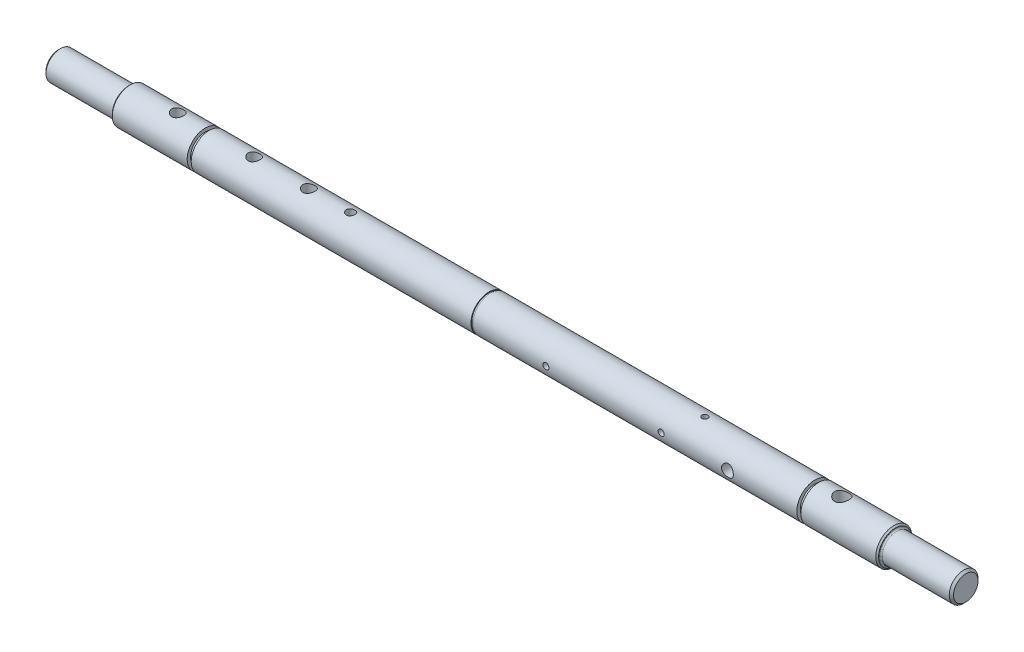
from build123d import *

# Parameters (mm, degrees)
ESQUISSE2_R             = 4.125
ESQUISSE2_R_2           = 2
ESQUISSE2_R_3           = 5
ESQUISSE2_R_4           = 2.05
ENL_V_MAT_EXTRU_1_DEPTH = 15
ESQUISSE3_R             = 4.125
ESQUISSE3_R_2           = 2.1
ENL_V_MAT_EXTRU_2_DEPTH = 15
ESQUISSE4_R             = 3
ENL_V_MAT_EXTRU_3_DEPTH = 631.247967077


with BuildPart() as part:
    # Esquisse1 → Base-R_volution (revolve)
    with BuildSketch(Plane.XY, mode=Mode.PRIVATE) as base_r_volution_sk:
        with BuildLine():
            Line((0, 0), (0, 8.5))
            Line((0, 8.5), (1.5, 10))
            Line((1.5, 10), (48, 10))
            ThreePointArc((48, 10), (48.707106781, 10.292893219), (49, 11))
            Line((49, 11), (49, 11.5))
            Line((49, 11.5), (50, 12.5))
            Line((50, 12.5), (102, 12.5))
            Line((102, 12.5), (102, 10.1))
            Line((102, 10.1), (104.8, 10.1))
            Line((104.8, 10.1), (104.8, 12.5))
            Line((104.8, 12.5), (299, 12.5))
            Line((299, 12.5), (299, 11.95))
            Line((299, 11.95), (300.3, 11.95))
            Line((300.3, 11.95), (300.3, 12.5))
            Line((300.3, 12.5), (525.2, 12.5))
            Line((525.2, 12.5), (525.2, 10.1))
            Line((525.2, 10.1), (528, 10.1))
            Line((528, 10.1), (528, 12.5))
            Line((528, 12.5), (580, 12.5))
            Line((580, 12.5), (581, 11.5))
            Line((581, 11.5), (581, 11))
            ThreePointArc((581, 11), (581.292893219, 10.292893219), (582, 10))
            Line((582, 10), (628.5, 10))
            Line((628.5, 10), (630, 8.5))
            Line((630, 8.5), (630, 0))
            Line((630, 0), (0, 0))
        make_face()
    revolve(base_r_volution_sk.sketch.rotate(Axis((0, 0, 0), (1, 0, 0)), 90), axis=Axis((0, 0, 0), (1, 0, 0)))

    # Esquisse2 → Enl_v. mat.-Extru.1 (cut, symmetric)
    with BuildSketch(Plane(origin=(0, 0, 0), x_dir=(1, 0, 0), z_dir=(0, 1, 0))):
        with Locations(Location((83, 0, 0), (0, 0, 270))):
            Circle(ESQUISSE2_R)
        with Locations(Location((136, 0, 0), (0, 0, 270))):
            Circle(ESQUISSE2_R)
        with Locations(Location((174, 0, 0), (0, 0, 270))):
            Circle(ESQUISSE2_R)
        with Locations(Location((203, 0, 0), (0, 0, 270))):
            Circle(ESQUISSE2_R_2)
        with Locations(Location((543.996189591, 0, 0), (0, 0, 270))):
            Circle(ESQUISSE2_R_3)
        with Locations(Location((448.996189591, 0, 0), (0, 0, 270))):
            Circle(ESQUISSE2_R_4)
    extrude(amount=ENL_V_MAT_EXTRU_1_DEPTH, both=True, mode=Mode.SUBTRACT)

    # Esquisse3 → Enl_v. mat.-Extru.2 (cut, symmetric)
    with BuildSketch(Plane.XY):
        with Locations((476.996189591, 0)):
            Circle(ESQUISSE3_R)
        with Locations((430.996189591, 0)):
            Circle(ESQUISSE3_R_2)
        with Locations((350.996189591, 0)):
            Circle(ESQUISSE3_R_2)
    extrude(amount=ENL_V_MAT_EXTRU_2_DEPTH, both=True, mode=Mode.SUBTRACT)

    # Esquisse4 → Enl_v. mat.-Extru.3 (cut, through all)
    with BuildSketch(Plane(origin=(0, 0, 0), x_dir=(1, 0, 0), z_dir=(0, 1, 0))):
        with Locations(Location((203, 0, 0), (0, 0, 180))):
            Circle(ESQUISSE4_R)
    extrude(amount=ENL_V_MAT_EXTRU_3_DEPTH, mode=Mode.SUBTRACT)


solid = part.part
